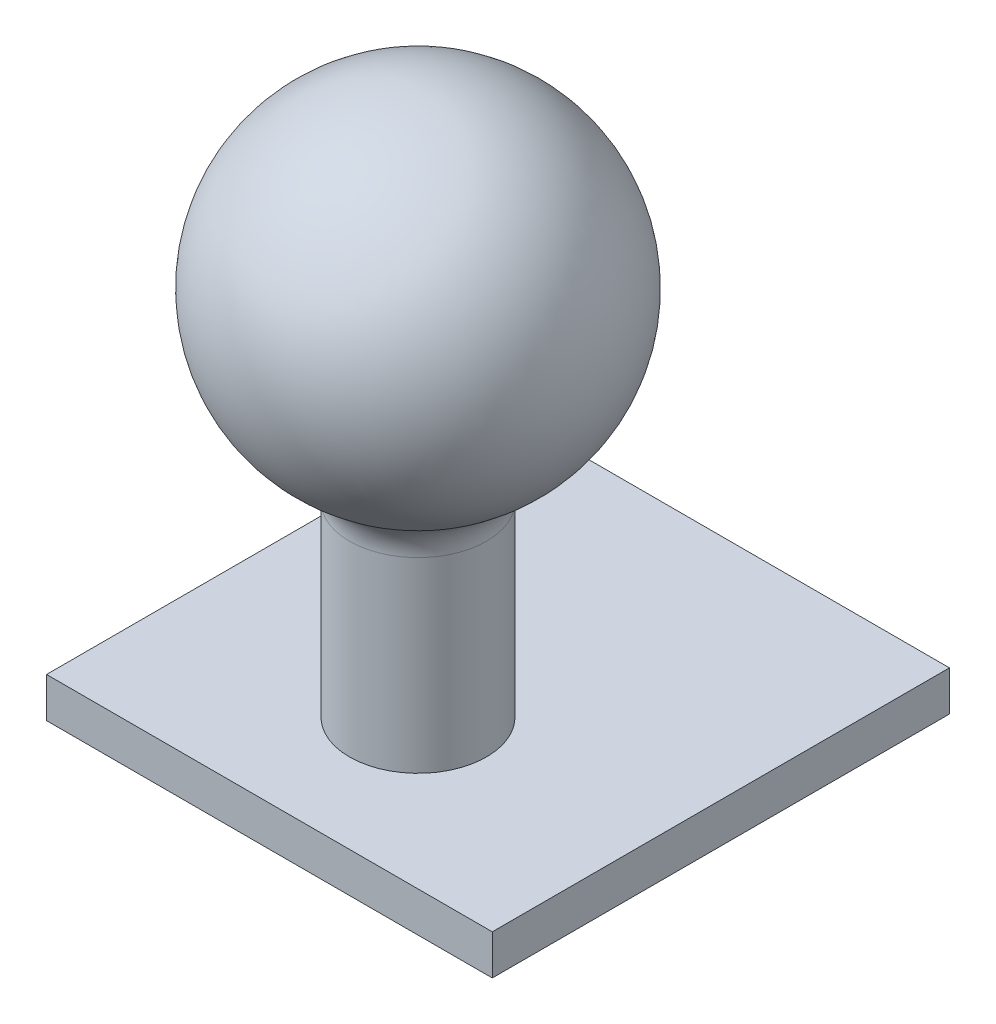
from build123d import *

# Parameters (mm, degrees)
SKETCH2_W           = 19.5
SKETCH2_H           = 20
BOSS_EXTRUDE1_DEPTH = 1.75
SKETCH3_W           = 19.5
SKETCH3_H           = 3.5
CUT_EXTRUDE1_DEPTH  = 28.552223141
SKETCH4_W           = 19.5
SKETCH4_H           = 1.75
BOSS_EXTRUDE2_DEPTH = 3.5
FILLET1_R           = 2


with BuildPart() as part:
    # Sketch1 → Revolve1 (revolve)
    with BuildSketch(Plane(origin=(0, 0, 0), x_dir=(0, 0, -1), z_dir=(1, 0, 0)), mode=Mode.PRIVATE) as revolve1_sk:
        with BuildLine():
            Line((3, -6.873863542), (3, -16.25))
            Line((3, -16.25), (6, -16.25))
            Line((6, -16.25), (6, -18))
            Line((6, -18), (0, -18))
            Line((0, -18), (0, -7.5))
            Line((0, -7.5), (0, 7.5))
            ThreePointArc((0, 7.5), (7.341797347, 1.532322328), (3, -6.873863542))
        make_face()
    revolve(revolve1_sk.sketch.rotate(Axis((0, 0, 0), (0, -1, 0)), 180), axis=Axis((0, 0, 0), (0, -1, 0)))

    # Sketch2 → Boss-Extrude1 (add)
    with BuildSketch(Plane.XZ.offset(18)):
        Rectangle(SKETCH2_W, SKETCH2_H)
    extrude(amount=-BOSS_EXTRUDE1_DEPTH)

    # Sketch3 → Cut-Extrude1 (cut, through all)
    with BuildSketch(Plane(origin=(0, -16.25, 0), x_dir=(1, 0, 0), z_dir=(0, 1, 0))):
        with Locations((0, -8.25)):
            Rectangle(SKETCH3_W, SKETCH3_H)
    extrude(amount=-CUT_EXTRUDE1_DEPTH, mode=Mode.SUBTRACT)

    # Sketch4 → Boss-Extrude2 (add)
    with BuildSketch(Plane(origin=(0, 0, -10), x_dir=(-1, 0, 0), z_dir=(0, 0, -1))):
        with Locations((0, -17.125)):
            Rectangle(SKETCH4_W, SKETCH4_H)
    extrude(amount=BOSS_EXTRUDE2_DEPTH)

    # Fillet1
    fillet1_edges = [part.edges().sort_by_distance(p)[0] for p in [
        (0, -6.873863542, -3),
    ]]
    fillet(fillet1_edges, radius=FILLET1_R)


solid = part.part
